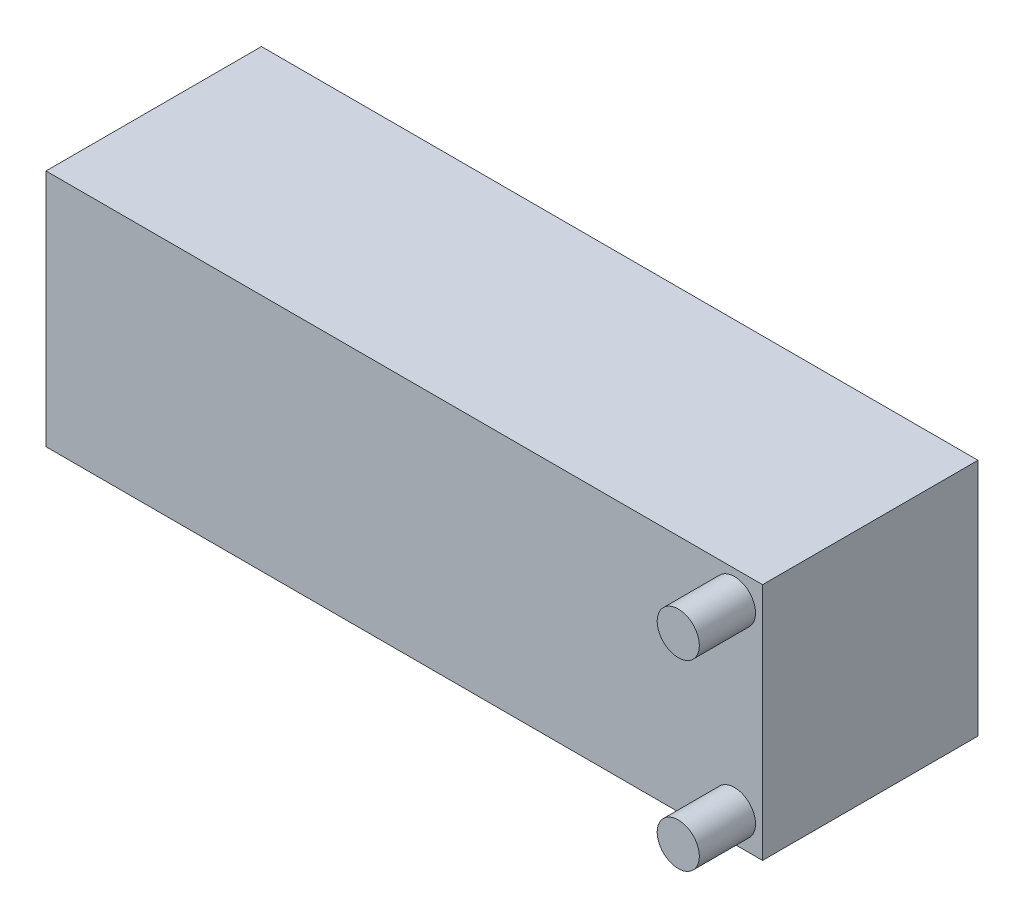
ISO-10303-21;
HEADER;
FILE_DESCRIPTION(('STEP AP214'),'2;1');
FILE_NAME('part.step','',(''),(''),'','','');
FILE_SCHEMA(('AUTOMOTIVE_DESIGN { 1 0 10303 214 1 1 1 1 }'));
ENDSEC;
DATA;
#1=APPLICATION_CONTEXT('core data for automotive mechanical design processes');
#2=APPLICATION_PROTOCOL_DEFINITION('international standard','automotive_design',2000,#1);
#3=PRODUCT_CONTEXT('',#1,'mechanical');
#4=PRODUCT('Part','Part','',(#3));
#5=PRODUCT_RELATED_PRODUCT_CATEGORY('part','',(#4));
#6=PRODUCT_DEFINITION_FORMATION('','',#4);
#7=PRODUCT_DEFINITION_CONTEXT('part definition',#1,'design');
#8=PRODUCT_DEFINITION('design','',#6,#7);
#9=PRODUCT_DEFINITION_SHAPE('','',#8);
#10=(LENGTH_UNIT() NAMED_UNIT(*) SI_UNIT(.MILLI.,.METRE.));
#11=(NAMED_UNIT(*) PLANE_ANGLE_UNIT() SI_UNIT($,.RADIAN.));
#12=(NAMED_UNIT(*) SI_UNIT($,.STERADIAN.) SOLID_ANGLE_UNIT());
#13=UNCERTAINTY_MEASURE_WITH_UNIT(LENGTH_MEASURE(1.E-05),#10,'distance_accuracy_value','');
#14=(GEOMETRIC_REPRESENTATION_CONTEXT(3) GLOBAL_UNCERTAINTY_ASSIGNED_CONTEXT((#13)) GLOBAL_UNIT_ASSIGNED_CONTEXT((#10,
#11,#12)) REPRESENTATION_CONTEXT('',''));
#15=CARTESIAN_POINT('',(0.,0.,0.));
#16=DIRECTION('',(0.,0.,1.));
#17=DIRECTION('',(1.,0.,0.));
#18=AXIS2_PLACEMENT_3D('',#15,#16,#17);
#19=CARTESIAN_POINT('',(0.,51.,0.));
#20=DIRECTION('',(1.,0.,0.));
#21=DIRECTION('',(0.,0.,-1.));
#22=AXIS2_PLACEMENT_3D('',#19,#20,#21);
#23=PLANE('',#22);
#24=DIRECTION('',(0.,0.,1.));
#25=VECTOR('',#24,1.);
#26=CARTESIAN_POINT('',(0.,0.,0.));
#27=LINE('',#26,#25);
#28=CARTESIAN_POINT('',(0.,0.,-46.));
#29=VERTEX_POINT('',#28);
#30=CARTESIAN_POINT('',(0.,0.,0.));
#31=VERTEX_POINT('',#30);
#32=EDGE_CURVE('E100',#29,#31,#27,.T.);
#33=ORIENTED_EDGE('',*,*,#32,.T.);
#34=DIRECTION('',(0.,-1.,0.));
#35=VECTOR('',#34,1.);
#36=CARTESIAN_POINT('',(0.,51.,0.));
#37=LINE('',#36,#35);
#38=CARTESIAN_POINT('',(0.,51.,0.));
#39=VERTEX_POINT('',#38);
#40=EDGE_CURVE('E91',#39,#31,#37,.T.);
#41=ORIENTED_EDGE('',*,*,#40,.F.);
#42=DIRECTION('',(0.,0.,1.));
#43=VECTOR('',#42,1.);
#44=CARTESIAN_POINT('',(0.,51.,0.));
#45=LINE('',#44,#43);
#46=CARTESIAN_POINT('',(0.,51.,-46.));
#47=VERTEX_POINT('',#46);
#48=EDGE_CURVE('E85',#47,#39,#45,.T.);
#49=ORIENTED_EDGE('',*,*,#48,.F.);
#50=DIRECTION('',(0.,-1.,0.));
#51=VECTOR('',#50,1.);
#52=CARTESIAN_POINT('',(0.,51.,-46.));
#53=LINE('',#52,#51);
#54=EDGE_CURVE('E96',#47,#29,#53,.T.);
#55=ORIENTED_EDGE('',*,*,#54,.T.);
#56=EDGE_LOOP('',(#33,#41,#49,#55));
#57=FACE_BOUND('',#56,.T.);
#58=ADVANCED_FACE('F33',(#57),#23,.F.);
#59=CARTESIAN_POINT('',(0.,51.,0.));
#60=DIRECTION('',(0.,0.,-1.));
#61=DIRECTION('',(-1.,0.,0.));
#62=AXIS2_PLACEMENT_3D('',#59,#60,#61);
#63=PLANE('',#62);
#64=CARTESIAN_POINT('',(147.,6.,0.));
#65=DIRECTION('',(0.,0.,-1.));
#66=DIRECTION('',(-1.,0.,0.));
#67=AXIS2_PLACEMENT_3D('',#64,#65,#66);
#68=CIRCLE('',#67,4.49999999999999);
#69=CARTESIAN_POINT('',(142.5,6.,0.));
#70=VERTEX_POINT('',#69);
#71=EDGE_CURVE('E11',#70,#70,#68,.F.);
#72=ORIENTED_EDGE('',*,*,#71,.F.);
#73=EDGE_LOOP('',(#72));
#74=FACE_BOUND('',#73,.T.);
#75=CARTESIAN_POINT('',(147.,45.,0.));
#76=DIRECTION('',(0.,0.,-1.));
#77=DIRECTION('',(-1.,0.,0.));
#78=AXIS2_PLACEMENT_3D('',#75,#76,#77);
#79=CIRCLE('',#78,4.49999999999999);
#80=CARTESIAN_POINT('',(142.5,45.,0.));
#81=VERTEX_POINT('',#80);
#82=EDGE_CURVE('E41',#81,#81,#79,.F.);
#83=ORIENTED_EDGE('',*,*,#82,.F.);
#84=EDGE_LOOP('',(#83));
#85=FACE_BOUND('',#84,.T.);
#86=DIRECTION('',(1.,0.,0.));
#87=VECTOR('',#86,1.);
#88=CARTESIAN_POINT('',(0.,0.,0.));
#89=LINE('',#88,#87);
#90=CARTESIAN_POINT('',(153.,0.,0.));
#91=VERTEX_POINT('',#90);
#92=EDGE_CURVE('E90',#31,#91,#89,.T.);
#93=ORIENTED_EDGE('',*,*,#92,.T.);
#94=DIRECTION('',(0.,-1.,0.));
#95=VECTOR('',#94,1.);
#96=CARTESIAN_POINT('',(153.,51.,0.));
#97=LINE('',#96,#95);
#98=CARTESIAN_POINT('',(153.,51.,0.));
#99=VERTEX_POINT('',#98);
#100=EDGE_CURVE('E88',#99,#91,#97,.T.);
#101=ORIENTED_EDGE('',*,*,#100,.F.);
#102=DIRECTION('',(1.,0.,0.));
#103=VECTOR('',#102,1.);
#104=CARTESIAN_POINT('',(0.,51.,0.));
#105=LINE('',#104,#103);
#106=EDGE_CURVE('E80',#39,#99,#105,.T.);
#107=ORIENTED_EDGE('',*,*,#106,.F.);
#108=ORIENTED_EDGE('',*,*,#40,.T.);
#109=EDGE_LOOP('',(#93,#101,#107,#108));
#110=FACE_BOUND('',#109,.T.);
#111=ADVANCED_FACE('F89',(#74,#85,#110),#63,.F.);
#112=CARTESIAN_POINT('',(153.,51.,0.));
#113=DIRECTION('',(-1.,0.,0.));
#114=DIRECTION('',(0.,0.,1.));
#115=AXIS2_PLACEMENT_3D('',#112,#113,#114);
#116=PLANE('',#115);
#117=DIRECTION('',(0.,0.,-1.));
#118=VECTOR('',#117,1.);
#119=CARTESIAN_POINT('',(153.,0.,0.));
#120=LINE('',#119,#118);
#121=CARTESIAN_POINT('',(153.,0.,-46.));
#122=VERTEX_POINT('',#121);
#123=EDGE_CURVE('E66',#91,#122,#120,.T.);
#124=ORIENTED_EDGE('',*,*,#123,.T.);
#125=DIRECTION('',(0.,-1.,0.));
#126=VECTOR('',#125,1.);
#127=CARTESIAN_POINT('',(153.,51.,-46.));
#128=LINE('',#127,#126);
#129=CARTESIAN_POINT('',(153.,51.,-46.));
#130=VERTEX_POINT('',#129);
#131=EDGE_CURVE('E92',#130,#122,#128,.T.);
#132=ORIENTED_EDGE('',*,*,#131,.F.);
#133=DIRECTION('',(0.,0.,-1.));
#134=VECTOR('',#133,1.);
#135=CARTESIAN_POINT('',(153.,51.,0.));
#136=LINE('',#135,#134);
#137=EDGE_CURVE('E83',#99,#130,#136,.T.);
#138=ORIENTED_EDGE('',*,*,#137,.F.);
#139=ORIENTED_EDGE('',*,*,#100,.T.);
#140=EDGE_LOOP('',(#124,#132,#138,#139));
#141=FACE_BOUND('',#140,.T.);
#142=ADVANCED_FACE('F94',(#141),#116,.F.);
#143=CARTESIAN_POINT('',(0.,51.,-46.));
#144=DIRECTION('',(0.,0.,1.));
#145=DIRECTION('',(1.,0.,0.));
#146=AXIS2_PLACEMENT_3D('',#143,#144,#145);
#147=PLANE('',#146);
#148=DIRECTION('',(-1.,0.,0.));
#149=VECTOR('',#148,1.);
#150=CARTESIAN_POINT('',(0.,0.,-46.));
#151=LINE('',#150,#149);
#152=EDGE_CURVE('E72',#122,#29,#151,.T.);
#153=ORIENTED_EDGE('',*,*,#152,.T.);
#154=ORIENTED_EDGE('',*,*,#54,.F.);
#155=DIRECTION('',(-1.,0.,0.));
#156=VECTOR('',#155,1.);
#157=CARTESIAN_POINT('',(0.,51.,-46.));
#158=LINE('',#157,#156);
#159=EDGE_CURVE('E49',#130,#47,#158,.T.);
#160=ORIENTED_EDGE('',*,*,#159,.F.);
#161=ORIENTED_EDGE('',*,*,#131,.T.);
#162=EDGE_LOOP('',(#153,#154,#160,#161));
#163=FACE_BOUND('',#162,.T.);
#164=ADVANCED_FACE('F121',(#163),#147,.F.);
#165=CARTESIAN_POINT('',(0.,51.,0.));
#166=DIRECTION('',(0.,-1.,0.));
#167=DIRECTION('',(0.,0.,-1.));
#168=AXIS2_PLACEMENT_3D('',#165,#166,#167);
#169=PLANE('',#168);
#170=ORIENTED_EDGE('',*,*,#48,.T.);
#171=ORIENTED_EDGE('',*,*,#106,.T.);
#172=ORIENTED_EDGE('',*,*,#137,.T.);
#173=ORIENTED_EDGE('',*,*,#159,.T.);
#174=EDGE_LOOP('',(#170,#171,#172,#173));
#175=FACE_BOUND('',#174,.T.);
#176=ADVANCED_FACE('F81',(#175),#169,.F.);
#177=CARTESIAN_POINT('',(0.,0.,0.));
#178=DIRECTION('',(0.,-1.,0.));
#179=DIRECTION('',(0.,0.,-1.));
#180=AXIS2_PLACEMENT_3D('',#177,#178,#179);
#181=PLANE('',#180);
#182=ORIENTED_EDGE('',*,*,#32,.F.);
#183=ORIENTED_EDGE('',*,*,#152,.F.);
#184=ORIENTED_EDGE('',*,*,#123,.F.);
#185=ORIENTED_EDGE('',*,*,#92,.F.);
#186=EDGE_LOOP('',(#182,#183,#184,#185));
#187=FACE_BOUND('',#186,.T.);
#188=ADVANCED_FACE('F129',(#187),#181,.T.);
#189=CARTESIAN_POINT('',(147.,45.,12.));
#190=DIRECTION('',(0.,0.,-1.));
#191=DIRECTION('',(-1.,0.,0.));
#192=AXIS2_PLACEMENT_3D('',#189,#190,#191);
#193=CYLINDRICAL_SURFACE('',#192,4.49999999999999);
#194=CARTESIAN_POINT('',(147.,45.,12.));
#195=DIRECTION('',(0.,0.,1.));
#196=DIRECTION('',(1.,0.,0.));
#197=AXIS2_PLACEMENT_3D('',#194,#195,#196);
#198=CIRCLE('',#197,4.49999999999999);
#199=CARTESIAN_POINT('',(151.5,45.,12.));
#200=VERTEX_POINT('',#199);
#201=EDGE_CURVE('E103',#200,#200,#198,.T.);
#202=ORIENTED_EDGE('',*,*,#201,.F.);
#203=EDGE_LOOP('',(#202));
#204=FACE_BOUND('',#203,.T.);
#205=ORIENTED_EDGE('',*,*,#82,.T.);
#206=EDGE_LOOP('',(#205));
#207=FACE_BOUND('',#206,.T.);
#208=ADVANCED_FACE('F112',(#204,#207),#193,.T.);
#209=CARTESIAN_POINT('',(147.,45.,12.));
#210=DIRECTION('',(0.,0.,1.));
#211=DIRECTION('',(1.,0.,0.));
#212=AXIS2_PLACEMENT_3D('',#209,#210,#211);
#213=PLANE('',#212);
#214=ORIENTED_EDGE('',*,*,#201,.T.);
#215=EDGE_LOOP('',(#214));
#216=FACE_BOUND('',#215,.T.);
#217=ADVANCED_FACE('F137',(#216),#213,.T.);
#218=CARTESIAN_POINT('',(147.,6.,12.));
#219=DIRECTION('',(0.,0.,-1.));
#220=DIRECTION('',(-1.,0.,0.));
#221=AXIS2_PLACEMENT_3D('',#218,#219,#220);
#222=CYLINDRICAL_SURFACE('',#221,4.49999999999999);
#223=CARTESIAN_POINT('',(147.,6.,12.));
#224=DIRECTION('',(0.,0.,1.));
#225=DIRECTION('',(1.,0.,0.));
#226=AXIS2_PLACEMENT_3D('',#223,#224,#225);
#227=CIRCLE('',#226,4.49999999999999);
#228=CARTESIAN_POINT('',(151.5,6.,12.));
#229=VERTEX_POINT('',#228);
#230=EDGE_CURVE('E153',#229,#229,#227,.T.);
#231=ORIENTED_EDGE('',*,*,#230,.F.);
#232=EDGE_LOOP('',(#231));
#233=FACE_BOUND('',#232,.T.);
#234=ORIENTED_EDGE('',*,*,#71,.T.);
#235=EDGE_LOOP('',(#234));
#236=FACE_BOUND('',#235,.T.);
#237=ADVANCED_FACE('F141',(#233,#236),#222,.T.);
#238=CARTESIAN_POINT('',(147.,6.,12.));
#239=DIRECTION('',(0.,0.,1.));
#240=DIRECTION('',(1.,0.,0.));
#241=AXIS2_PLACEMENT_3D('',#238,#239,#240);
#242=PLANE('',#241);
#243=ORIENTED_EDGE('',*,*,#230,.T.);
#244=EDGE_LOOP('',(#243));
#245=FACE_BOUND('',#244,.T.);
#246=ADVANCED_FACE('F145',(#245),#242,.T.);
#247=CLOSED_SHELL('',(#58,#111,#142,#164,#176,#188,#208,#217,#237,#246));
#248=MANIFOLD_SOLID_BREP('B2',#247);
#249=ADVANCED_BREP_SHAPE_REPRESENTATION('',(#18,#248),#14);
#250=SHAPE_DEFINITION_REPRESENTATION(#9,#249);
ENDSEC;
END-ISO-10303-21;
